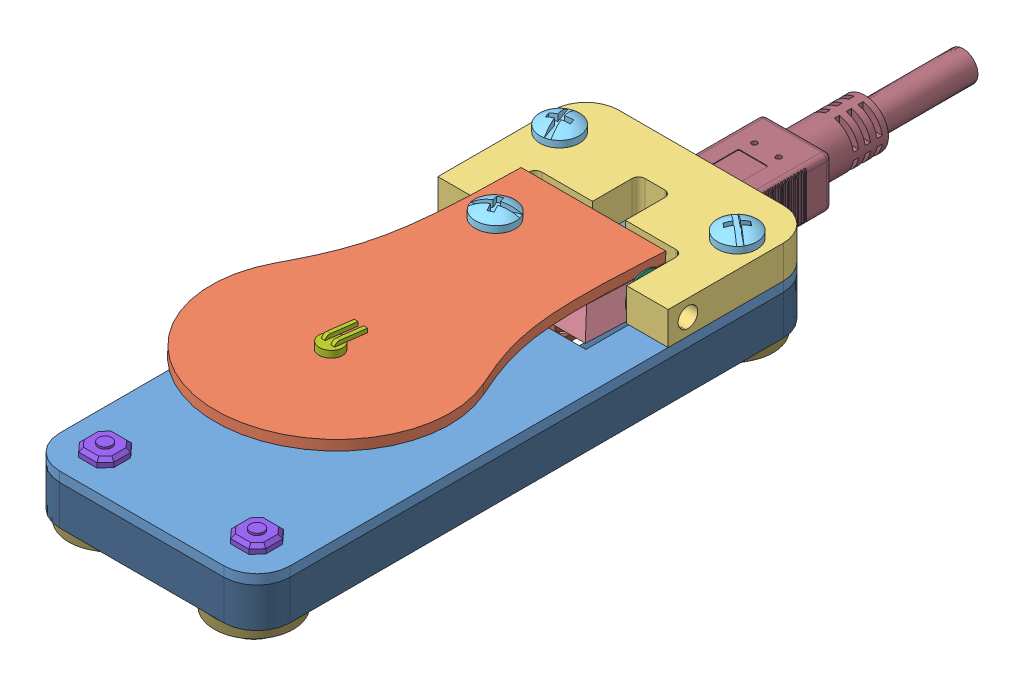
SolidWorks assembly Mivo.SLDASM, configuration Standard (file format 6000). Lengths in mm.
Overall size (39.21 20.12 128.9).
22 component instances, 13 part files, 35 mates.
Components (placement in the parent):
- Bottom-1: Bottom.SLDPRT [Standard] at (-1.1305 -4.7293 80) size (35 1.5 85)
- Top-1: Top.SLDPRT [Standard] at (-1.1305 1.6511 96.4042) x (1 0 0) z (0 0.039233 0.99923) size (35 1.5 57.5)
- Hinge1-1: Hinge1.SLDPRT [Standard] at (-1.1305 -3.2293 102.5) x (-1 0 0) z (0 0 -1) size (35 5 22.5)
- Hinge2-1: Hinge2.SLDPRT [Standard] at (-1.1305 1.6511 96.4042) x (-1 0 0) z (0 0.039233 0.99923) size (22 5 12)
- Screw-1: Screw.SLDPRT [Standard] at (-14.6305 3.3973 88) x (0.943436 0 -0.331554) z (0.331554 0 0.943436) size (6 9.07 6)
- Screw-2: Screw.SLDPRT [Standard] at (12.3695 2.941 88) x (0.625261 0 -0.780416) z (0.780416 0 0.625261) size (6 9.07 6)
- Washer-1: Washer.SLDPRT [Standard] at (-12.1305 -0.7293 99.5) x (0 1 0) z (0 0 1) size (6 0.2 6)
- Washer-2: Washer.SLDPRT [Standard] at (10.0695 -0.7293 99.5) x (0 1 0) z (0 0 1) size (6 0.2 6)
- LED-1: LED.SLDPRT [Standard] at (-1.1305 5.7185 136.2753) x (-0.995731 -0.003621 -0.092228) z (-0.092299 0.039066 0.994965) size (3.5 4.6 5.95)
- LED-2: LED.SLDPRT [Standard] at (-1.1305 -5.7293 136.5) x (0.997325 0 -0.073095) z (0.073095 0 0.997325) size (3.5 4.6 5.95)
- ButtonSMD-1: ButtonSMD.sldprt [Standard] at (10.3596 -3.2293 158.9814) x (1 0 0) z (0 1 0) size (6.4 5.23 1.51)
- ButtonSMD-2: ButtonSMD.sldprt [Standard] at (-12.5664 -3.2293 159.1533) x (1 0 0) z (0 1 0) size (6.4 5.23 1.51)
- molex_0473460001-1: molex_0473460001.SLDPRT [Standard] at (-1.0814 -3.2593 82.3766) x (-1 0 0) z (0 0 -1) size (7.98 2.76 5.43) (hidden)
- Screw-3: Screw.SLDPRT [Standard] at (-1.3988 -5.9257 125.5735) x (-0.142188 0 0.98984) z (0.98984 0 0.142188) size (6 9.07 6)
- Base-1: Base.SLDPRT [Standard] at (-1.1305 -10.7293 165) size (35 6 85)
- trinket-1: trinket.SLDPRT [Default] at (-1.8884 -4.7293 95) x (1 0 0) z (0 0 -1) size (15.1 5 31)
- Feet-1: Feet.SLDPRT [Standard] at (-12.5811 -10.7293 158.6486) x (-0.837169 0 -0.546944) z (-0.546944 0 0.837169) size (12 3 12)
- Feet-2: Feet.SLDPRT [Standard] at (9.9632 -10.7293 159.0744) x (-0.837169 0 -0.546944) z (-0.546944 0 0.837169) size (12 3 12)
- Feet-3: Feet.SLDPRT [Standard] at (-12.5369 -10.7293 86.182) x (-0.837169 0 -0.546944) z (-0.546944 0 0.837169) size (12 3 12) (hidden)
- USB-Mini B_Cable-1: USB-Mini B_Cable.SLDPRT [Standard] at (-2.8052 -7.7293 78.377) x (-1 0 0) z (0 0 1) size (10.5 7.7 46.9)
- Feet-4: Feet.SLDPRT [Standard] at (10.0177 -10.7293 86.2199) x (-0.837169 0 -0.546944) z (-0.546944 0 0.837169) size (12 3 12)
- Screw-4: Screw.SLDPRT [Standard] at (-7.1305 4.4891 105.2997) x (-0.414763 -0.035699 -0.909229) z (0.90993 -0.016272 -0.414443) size (6 9.07 6)
Mates (geometry in assembly coordinates):
- Deckungsgleich4: coincident aligned: plane of Bottom-1 through (16.3695 -3.2293 80) normal (1 0 0); plane of Hinge1-1 through (16.3695 1.7707 102.5) normal (1 0 0)
- Deckungsgleich5: coincident anti-aligned: plane of Top-1 through (-12.7726 2.4344 116.3561) normal (0 -0.99923 0.039233); plane of Hinge2-1 through (-1.1305 1.6511 96.4042) normal (0 0.99923 -0.039233)
- Deckungsgleich6: coincident aligned: plane of Top-1 through (-12.1305 3.1499 96.3454) normal (0 -0.039233 -0.99923); plane of Hinge2-1 through (9.8695 -3.3451 96.6004) normal (0 -0.039233 -0.99923)
- Deckungsgleich7: coincident: line of Top-1 through (9.8695 3.1499 96.3454) axis (0 -0.99923 0.039233); plane of Hinge2-1 through (9.8695 -3.3451 96.6004) normal (1 0 0)
- Deckungsgleich8: coincident anti-aligned: plane of Bottom-1 through (-1.1305 -3.2293 80) normal (0 1 0); plane of Hinge1-1 through (-11.3305 -3.2293 95) normal (0 -1 0)
- Konzentrisch2: concentric anti-aligned: cylinder of Hinge1-1 through (-14.6305 1.7707 88) axis (0 -1 0) radius 1.5; cylinder of Screw-1 through (-14.6305 57.8742 88) axis (0 1 0) radius 1.5
- Konzentrisch3: concentric anti-aligned: cylinder of Hinge1-1 through (12.3695 1.7707 88) axis (0 -1 0) radius 1.5; cylinder of Screw-2 through (12.3695 57.4179 88) axis (0 1 0) radius 1.5
- Konzentrisch4: concentric anti-aligned: cylinder of Hinge1-1 through (16.3695 -0.7293 99.5) axis (-1 0 0) radius 1.5; cylinder of Washer-2 through (9.8695 -0.7293 99.5) axis (1 0 0) radius 1.5
- Konzentrisch5: concentric anti-aligned: cylinder of Hinge1-1 through (16.3695 -0.7293 99.5) axis (-1 0 0) radius 1.5; cylinder of Washer-1 through (-12.3305 -0.7293 99.5) axis (1 0 0) radius 1.5
- Deckungsgleich9: coincident anti-aligned: plane of Hinge2-1 through (9.8695 -3.3451 96.6004) normal (1 0 0); plane of Washer-2 through (9.8695 -0.7293 99.5) normal (-1 0 0)
- Deckungsgleich10: coincident anti-aligned: plane of Hinge2-1 through (-12.1305 -3.3451 96.6004) normal (-1 0 0); plane of Washer-1 through (-12.1305 -0.7293 99.5) normal (1 0 0)
- Deckungsgleich11: coincident anti-aligned: plane of Hinge1-1 through (10.0695 1.7707 102.5) normal (-1 0 0); plane of Washer-2 through (10.0695 -0.7293 99.5) normal (1 0 0)
- Konzentrisch6: concentric aligned: cylinder of Top-1 through (-1.1305 4.7192 136.3146) axis (0 -0.99923 0.039233) radius 1.5; cylinder of LED-1 through (-1.1305 -59.3683 138.8309) axis (0 -0.99923 0.039233) radius 1.5
- Deckungsgleich15: coincident anti-aligned: plane of Top-1 through (-12.7726 3.9333 116.2972) normal (0 0.99923 -0.039233); plane of LED-1 through (0.612 4.7256 136.476) normal (0 -0.99923 0.039233)
- Konzentrisch7: concentric anti-aligned: cylinder of Bottom-1 through (-1.1305 -3.2293 136.5) axis (0 -1 0) radius 1.5; cylinder of LED-2 through (-1.1305 59.4077 136.5) axis (0 1 0) radius 1.5
- Deckungsgleich16: coincident anti-aligned: plane of Bottom-1 through (-1.1305 -4.7293 80) normal (0 -1 0); plane of LED-2 through (-2.8758 -4.7293 136.6279) normal (0 1 0)
- Deckungsgleich20: coincident anti-aligned: plane of Bottom-1 through (-1.1305 -3.2293 80) normal (0 1 0); plane of ButtonSMD-1 through (10.3596 -3.2293 158.9814) normal (0 -1 0)
- Deckungsgleich21: coincident anti-aligned: plane of Bottom-1 through (-1.1305 -3.2293 80) normal (0 1 0); plane of ButtonSMD-2 through (-12.5664 -3.2293 159.1533) normal (0 -1 0)
- Deckungsgleich22: coincident anti-aligned: plane of Bottom-1 through (-1.1305 -3.2293 80) normal (0 1 0); plane of molex_0473460001-1 through (-6.8359 -3.2293 87.917) normal (0 -1 0)
- Deckungsgleich23: coincident anti-aligned: plane of Bottom-1 through (-1.1305 -4.7293 80) normal (0 -1 0); plane of Base-1 through (-13.6305 -4.7293 160) normal (0 1 0)
- Deckungsgleich24: coincident aligned: plane of Bottom-1 through (-18.6305 -3.2293 80) normal (-1 0 0); plane of Base-1 through (-18.6305 -4.7293 85) normal (-1 0 0)
- Deckungsgleich25: coincident aligned: plane of Bottom-1 through (-18.6305 -3.2293 165) normal (0 0 1); plane of Base-1 through (-13.6305 -4.7293 165) normal (0 0 1)
- Deckungsgleich26: coincident anti-aligned: plane of Bottom-1 through (-1.1305 -4.7293 80) normal (0 -1 0); plane of trinket-1 through (-1.8884 -4.7293 95) normal (0 1 0)
- Parallel2: parallel aligned: plane of Bottom-1 through (-18.6305 -3.2293 80) normal (-1 0 0); plane of trinket-1 through (-9.4384 -5.7293 80) normal (-1 0 0)
- Deckungsgleich29: coincident aligned: plane of Bottom-1 through (-18.6305 -3.2293 80) normal (0 0 -1); plane of trinket-1 through (-9.4384 -5.7293 80) normal (0 0 -1)
- Deckungsgleich30: coincident anti-aligned: plane of Base-1 through (-13.6305 -10.7293 160) normal (0 -1 0); plane of Feet-1 through (-7.5581 -10.7293 161.9303) normal (0 1 0)
- Deckungsgleich31: coincident anti-aligned: plane of Base-1 through (-13.6305 -10.7293 160) normal (0 -1 0); plane of Feet-2 through (14.9862 -10.7293 162.3561) normal (0 1 0)
- Deckungsgleich32: coincident anti-aligned: plane of Base-1 through (-13.6305 -10.7293 160) normal (0 -1 0); plane of Feet-3 through (-7.5139 -10.7293 89.4636) normal (0 1 0)
- Deckungsgleich33: coincident anti-aligned: plane of trinket-1 through (-5.7884 -9.3293 80.25) normal (0 1 0); plane of USB-Mini B_Cable-1 through (0.3448 -9.3293 85.377) normal (0 -1 0)
- Deckungsgleich34: coincident aligned: plane of trinket-1 through (-5.7884 -7.9293 80.25) normal (-1 0 0); plane of USB-Mini B_Cable-1 through (-5.7884 -7.5559 78.377) normal (-1 0 0)
- Deckungsgleich35: coincident anti-aligned: plane of Base-1 through (-13.6305 -10.7293 160) normal (0 -1 0); plane of Feet-4 through (15.0407 -10.7293 89.5016) normal (0 1 0)
- Konzentrisch10: concentric aligned: cylinder of Hinge1-1 through (-14.6305 1.7707 88) axis (0 -1 0) radius 1.5; cylinder of Base-1 through (-14.6305 -4.7293 88) axis (0 -1 0) radius 1.15
- Deckungsgleich37: coincident aligned: cylinder of Hinge1-1 through (16.3695 -0.7293 99.5) axis (-1 0 0) radius 1.5; circle of Hinge2-1
- Konzentrisch11: concentric aligned: cylinder of Hinge2-1 through (-7.1305 -2.992 105.5935) axis (0 0.99923 -0.039233) radius 1.15; cylinder of Screw-4 through (-7.1305 58.9241 103.1624) axis (0 0.99923 -0.039233) radius 1.5
- Deckungsgleich39: coincident aligned: plane of Top-1 through (-12.7726 3.9333 116.2972) normal (0 0.99923 -0.039233); circle of Screw-4
